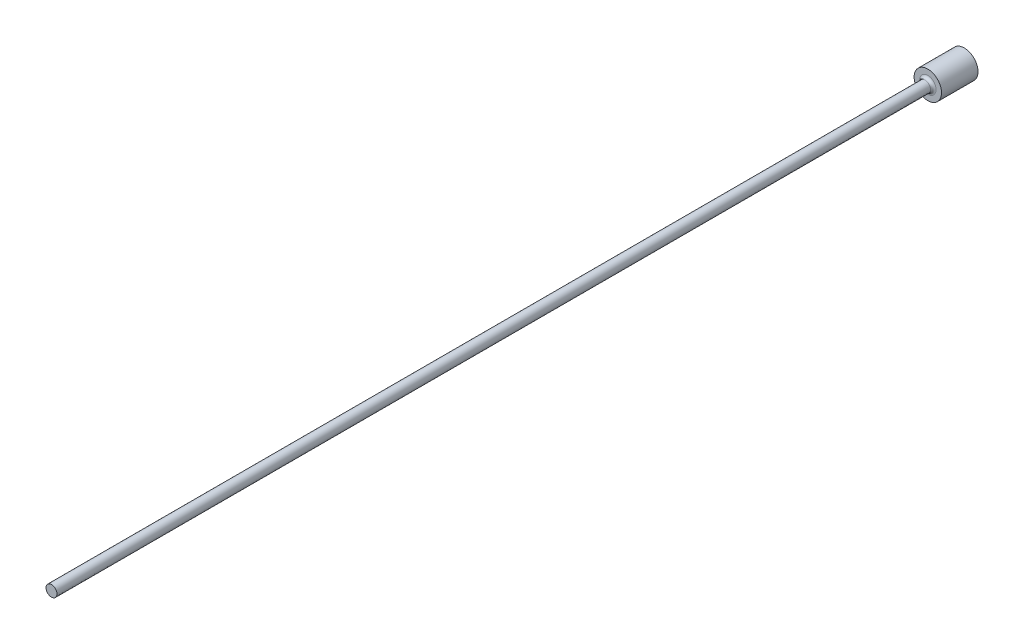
ISO-10303-21;
HEADER;
FILE_DESCRIPTION(('STEP AP214'),'2;1');
FILE_NAME('part.step','',(''),(''),'','','');
FILE_SCHEMA(('AUTOMOTIVE_DESIGN { 1 0 10303 214 1 1 1 1 }'));
ENDSEC;
DATA;
#1=APPLICATION_CONTEXT('core data for automotive mechanical design processes');
#2=APPLICATION_PROTOCOL_DEFINITION('international standard','automotive_design',2000,#1);
#3=PRODUCT_CONTEXT('',#1,'mechanical');
#4=PRODUCT('Part','Part','',(#3));
#5=PRODUCT_RELATED_PRODUCT_CATEGORY('part','',(#4));
#6=PRODUCT_DEFINITION_FORMATION('','',#4);
#7=PRODUCT_DEFINITION_CONTEXT('part definition',#1,'design');
#8=PRODUCT_DEFINITION('design','',#6,#7);
#9=PRODUCT_DEFINITION_SHAPE('','',#8);
#10=(LENGTH_UNIT() NAMED_UNIT(*) SI_UNIT(.MILLI.,.METRE.));
#11=(NAMED_UNIT(*) PLANE_ANGLE_UNIT() SI_UNIT($,.RADIAN.));
#12=(NAMED_UNIT(*) SI_UNIT($,.STERADIAN.) SOLID_ANGLE_UNIT());
#13=UNCERTAINTY_MEASURE_WITH_UNIT(LENGTH_MEASURE(1.E-05),#10,'distance_accuracy_value','');
#14=(GEOMETRIC_REPRESENTATION_CONTEXT(3) GLOBAL_UNCERTAINTY_ASSIGNED_CONTEXT((#13)) GLOBAL_UNIT_ASSIGNED_CONTEXT((#10,
#11,#12)) REPRESENTATION_CONTEXT('',''));
#15=CARTESIAN_POINT('',(0.,0.,0.));
#16=DIRECTION('',(0.,0.,1.));
#17=DIRECTION('',(1.,0.,0.));
#18=AXIS2_PLACEMENT_3D('',#15,#16,#17);
#19=CARTESIAN_POINT('',(1.5,0.,4.));
#20=DIRECTION('',(0.,0.,-1.));
#21=DIRECTION('',(-1.,0.,0.));
#22=AXIS2_PLACEMENT_3D('',#19,#20,#21);
#23=PLANE('',#22);
#24=CARTESIAN_POINT('',(0.,0.,4.));
#25=DIRECTION('',(0.,0.,-1.));
#26=DIRECTION('',(-1.,0.,0.));
#27=AXIS2_PLACEMENT_3D('',#24,#25,#26);
#28=CIRCLE('',#27,0.900000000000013);
#29=CARTESIAN_POINT('',(-0.900000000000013,0.,4.));
#30=VERTEX_POINT('',#29);
#31=EDGE_CURVE('E40',#30,#30,#28,.T.);
#32=ORIENTED_EDGE('',*,*,#31,.T.);
#33=EDGE_LOOP('',(#32));
#34=FACE_BOUND('',#33,.T.);
#35=CARTESIAN_POINT('',(0.,0.,4.));
#36=DIRECTION('',(0.,0.,-1.));
#37=DIRECTION('',(-1.,0.,0.));
#38=AXIS2_PLACEMENT_3D('',#35,#36,#37);
#39=CIRCLE('',#38,1.5);
#40=CARTESIAN_POINT('',(-1.5,0.,4.));
#41=VERTEX_POINT('',#40);
#42=EDGE_CURVE('E44',#41,#41,#39,.T.);
#43=ORIENTED_EDGE('',*,*,#42,.F.);
#44=EDGE_LOOP('',(#43));
#45=FACE_BOUND('',#44,.T.);
#46=ADVANCED_FACE('F33',(#34,#45),#23,.F.);
#47=CARTESIAN_POINT('',(0.,0.,-9.03322817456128));
#48=DIRECTION('',(0.,0.,-1.));
#49=DIRECTION('',(-1.,0.,0.));
#50=AXIS2_PLACEMENT_3D('',#47,#48,#49);
#51=CYLINDRICAL_SURFACE('',#50,1.5);
#52=CARTESIAN_POINT('',(0.,0.,0.));
#53=DIRECTION('',(0.,0.,-1.));
#54=DIRECTION('',(-1.,0.,0.));
#55=AXIS2_PLACEMENT_3D('',#52,#53,#54);
#56=CIRCLE('',#55,1.5);
#57=CARTESIAN_POINT('',(-1.5,0.,0.));
#58=VERTEX_POINT('',#57);
#59=EDGE_CURVE('E48',#58,#58,#56,.T.);
#60=ORIENTED_EDGE('',*,*,#59,.F.);
#61=EDGE_LOOP('',(#60));
#62=FACE_BOUND('',#61,.T.);
#63=ORIENTED_EDGE('',*,*,#42,.T.);
#64=EDGE_LOOP('',(#63));
#65=FACE_BOUND('',#64,.T.);
#66=ADVANCED_FACE('F68',(#62,#65),#51,.T.);
#67=CARTESIAN_POINT('',(0.,0.,0.));
#68=DIRECTION('',(0.,0.,1.));
#69=DIRECTION('',(1.,0.,0.));
#70=AXIS2_PLACEMENT_3D('',#67,#68,#69);
#71=PLANE('',#70);
#72=ORIENTED_EDGE('',*,*,#59,.T.);
#73=EDGE_LOOP('',(#72));
#74=FACE_BOUND('',#73,.T.);
#75=ADVANCED_FACE('F61',(#74),#71,.F.);
#76=CARTESIAN_POINT('',(0.,0.,100.));
#77=DIRECTION('',(0.,0.,-1.));
#78=DIRECTION('',(-1.,0.,0.));
#79=AXIS2_PLACEMENT_3D('',#76,#77,#78);
#80=PLANE('',#79);
#81=CARTESIAN_POINT('',(0.,0.,100.));
#82=DIRECTION('',(0.,0.,-1.));
#83=DIRECTION('',(-1.,0.,0.));
#84=AXIS2_PLACEMENT_3D('',#81,#82,#83);
#85=CIRCLE('',#84,0.600000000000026);
#86=CARTESIAN_POINT('',(-0.600000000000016,0.,100.));
#87=VERTEX_POINT('',#86);
#88=EDGE_CURVE('E53',#87,#87,#85,.T.);
#89=ORIENTED_EDGE('',*,*,#88,.F.);
#90=EDGE_LOOP('',(#89));
#91=FACE_BOUND('',#90,.T.);
#92=ADVANCED_FACE('F59',(#91),#80,.F.);
#93=CARTESIAN_POINT('',(0.,0.,-9.03322817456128));
#94=DIRECTION('',(0.,0.,-1.));
#95=DIRECTION('',(-1.,0.,0.));
#96=AXIS2_PLACEMENT_3D('',#93,#94,#95);
#97=CYLINDRICAL_SURFACE('',#96,0.600000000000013);
#98=CARTESIAN_POINT('',(0.,0.,4.3));
#99=DIRECTION('',(0.,0.,-1.));
#100=DIRECTION('',(-1.,0.,0.));
#101=AXIS2_PLACEMENT_3D('',#98,#99,#100);
#102=CIRCLE('',#101,0.600000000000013);
#103=CARTESIAN_POINT('',(-0.600000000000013,0.,4.3));
#104=VERTEX_POINT('',#103);
#105=EDGE_CURVE('E10',#104,#104,#102,.F.);
#106=ORIENTED_EDGE('',*,*,#105,.T.);
#107=EDGE_LOOP('',(#106));
#108=FACE_BOUND('',#107,.T.);
#109=ORIENTED_EDGE('',*,*,#88,.T.);
#110=EDGE_LOOP('',(#109));
#111=FACE_BOUND('',#110,.T.);
#112=ADVANCED_FACE('F57',(#108,#111),#97,.T.);
#113=CARTESIAN_POINT('',(0.,0.,4.3));
#114=DIRECTION('',(0.,0.,-1.));
#115=DIRECTION('',(-1.,0.,0.));
#116=AXIS2_PLACEMENT_3D('',#113,#114,#115);
#117=TOROIDAL_SURFACE('',#116,0.900000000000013,0.3);
#118=ORIENTED_EDGE('',*,*,#105,.F.);
#119=EDGE_LOOP('',(#118));
#120=FACE_BOUND('',#119,.T.);
#121=ORIENTED_EDGE('',*,*,#31,.F.);
#122=EDGE_LOOP('',(#121));
#123=FACE_BOUND('',#122,.T.);
#124=ADVANCED_FACE('F35',(#120,#123),#117,.F.);
#125=CLOSED_SHELL('',(#46,#66,#75,#92,#112,#124));
#126=MANIFOLD_SOLID_BREP('B2',#125);
#127=ADVANCED_BREP_SHAPE_REPRESENTATION('',(#18,#126),#14);
#128=SHAPE_DEFINITION_REPRESENTATION(#9,#127);
ENDSEC;
END-ISO-10303-21;
